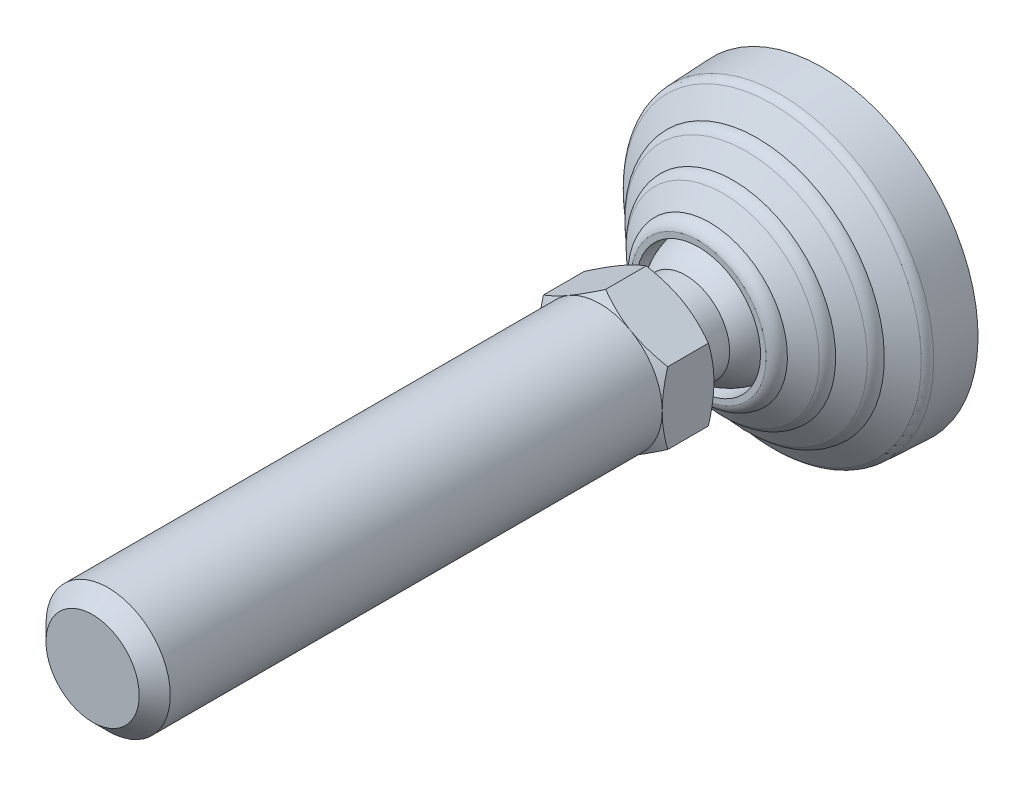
ISO-10303-21;
HEADER;
FILE_DESCRIPTION(('STEP AP214'),'2;1');
FILE_NAME('part.step','',(''),(''),'','','');
FILE_SCHEMA(('AUTOMOTIVE_DESIGN { 1 0 10303 214 1 1 1 1 }'));
ENDSEC;
DATA;
#1=APPLICATION_CONTEXT('core data for automotive mechanical design processes');
#2=APPLICATION_PROTOCOL_DEFINITION('international standard','automotive_design',2000,#1);
#3=PRODUCT_CONTEXT('',#1,'mechanical');
#4=PRODUCT('Part','Part','',(#3));
#5=PRODUCT_RELATED_PRODUCT_CATEGORY('part','',(#4));
#6=PRODUCT_DEFINITION_FORMATION('','',#4);
#7=PRODUCT_DEFINITION_CONTEXT('part definition',#1,'design');
#8=PRODUCT_DEFINITION('design','',#6,#7);
#9=PRODUCT_DEFINITION_SHAPE('','',#8);
#10=(LENGTH_UNIT() NAMED_UNIT(*) SI_UNIT(.MILLI.,.METRE.));
#11=(NAMED_UNIT(*) PLANE_ANGLE_UNIT() SI_UNIT($,.RADIAN.));
#12=(NAMED_UNIT(*) SI_UNIT($,.STERADIAN.) SOLID_ANGLE_UNIT());
#13=UNCERTAINTY_MEASURE_WITH_UNIT(LENGTH_MEASURE(1.E-05),#10,'distance_accuracy_value','');
#14=(GEOMETRIC_REPRESENTATION_CONTEXT(3) GLOBAL_UNCERTAINTY_ASSIGNED_CONTEXT((#13)) GLOBAL_UNIT_ASSIGNED_CONTEXT((#10,
#11,#12)) REPRESENTATION_CONTEXT('',''));
#15=CARTESIAN_POINT('',(0.,0.,0.));
#16=DIRECTION('',(0.,0.,1.));
#17=DIRECTION('',(1.,0.,0.));
#18=AXIS2_PLACEMENT_3D('',#15,#16,#17);
#19=CARTESIAN_POINT('',(0.,0.,30.));
#20=DIRECTION('',(0.,0.,-1.));
#21=DIRECTION('',(0.,1.,0.));
#22=AXIS2_PLACEMENT_3D('',#19,#20,#21);
#23=CYLINDRICAL_SURFACE('',#22,12.);
#24=CARTESIAN_POINT('',(-12.,0.,18.));
#25=CARTESIAN_POINT('',(-12.0000041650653,-0.196349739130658,18.));
#26=CARTESIAN_POINT('',(-11.9951810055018,-0.392699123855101,18.));
#27=CARTESIAN_POINT('',(-11.9759099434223,-0.784925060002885,18.));
#28=CARTESIAN_POINT('',(-11.9614620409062,-0.980801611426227,18.));
#29=CARTESIAN_POINT('',(-11.9229713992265,-1.37160975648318,18.));
#30=CARTESIAN_POINT('',(-11.8989286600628,-1.5665413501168,18.));
#31=CARTESIAN_POINT('',(-11.841307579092,-1.95499003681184,18.));
#32=CARTESIAN_POINT('',(-11.8077292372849,-2.14850712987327,18.));
#33=CARTESIAN_POINT('',(-11.7311174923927,-2.53366059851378,18.));
#34=CARTESIAN_POINT('',(-11.6880840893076,-2.72529697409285,18.));
#35=CARTESIAN_POINT('',(-11.5926659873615,-3.10622734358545,18.));
#36=CARTESIAN_POINT('',(-11.5402812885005,-3.29552133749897,18.));
#37=CARTESIAN_POINT('',(-11.4262867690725,-3.67131091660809,18.));
#38=CARTESIAN_POINT('',(-11.3646769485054,-3.85780650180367,18.));
#39=CARTESIAN_POINT('',(-11.2323806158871,-4.22754997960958,18.));
#40=CARTESIAN_POINT('',(-11.1616941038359,-4.41079787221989,18.));
#41=CARTESIAN_POINT('',(-11.011414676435,-4.77360450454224,18.));
#42=CARTESIAN_POINT('',(-10.9318217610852,-4.95316324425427,18.));
#43=CARTESIAN_POINT('',(-10.7639212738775,-5.30815899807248,18.));
#44=CARTESIAN_POINT('',(-10.6756137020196,-5.48359601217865,18.));
#45=CARTESIAN_POINT('',(-10.4904966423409,-5.82992567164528,17.9999999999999));
#46=CARTESIAN_POINT('',(-10.3936871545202,-6.00081831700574,17.9999999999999));
#47=CARTESIAN_POINT('',(-10.1917994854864,-6.33764754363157,17.9999999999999));
#48=CARTESIAN_POINT('',(-10.0867213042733,-6.50358412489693,17.9999999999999));
#49=CARTESIAN_POINT('',(-9.8685493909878,-6.83010146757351,17.9999999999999));
#50=CARTESIAN_POINT('',(-9.75545565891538,-6.99068222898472,17.9999999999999));
#51=CARTESIAN_POINT('',(-9.5215250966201,-7.30610107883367,17.9999999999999));
#52=CARTESIAN_POINT('',(-9.40068826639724,-7.4609391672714,17.9999999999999));
#53=CARTESIAN_POINT('',(-9.15156261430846,-7.76449965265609,17.9999999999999));
#54=CARTESIAN_POINT('',(-9.02327379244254,-7.91322204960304,17.9999999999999));
#55=CARTESIAN_POINT('',(-8.75955321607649,-8.20419286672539,17.9999999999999));
#56=CARTESIAN_POINT('',(-8.62412146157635,-8.3464412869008,17.9999999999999));
#57=CARTESIAN_POINT('',(-8.3464412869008,-8.62412146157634,17.9999999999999));
#58=CARTESIAN_POINT('',(-8.2041928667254,-8.75955321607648,17.9999999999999));
#59=CARTESIAN_POINT('',(-7.91322204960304,-9.02327379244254,17.9999999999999));
#60=CARTESIAN_POINT('',(-7.76449965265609,-9.15156261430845,17.9999999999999));
#61=CARTESIAN_POINT('',(-7.4609391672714,-9.40068826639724,17.9999999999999));
#62=CARTESIAN_POINT('',(-7.30610107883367,-9.5215250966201,17.9999999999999));
#63=CARTESIAN_POINT('',(-6.99068222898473,-9.75545565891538,17.9999999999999));
#64=CARTESIAN_POINT('',(-6.83010146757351,-9.8685493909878,17.9999999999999));
#65=CARTESIAN_POINT('',(-6.50358412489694,-10.0867213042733,17.9999999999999));
#66=CARTESIAN_POINT('',(-6.33764754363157,-10.1917994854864,17.9999999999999));
#67=CARTESIAN_POINT('',(-6.00081831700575,-10.3936871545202,17.9999999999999));
#68=CARTESIAN_POINT('',(-5.82992567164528,-10.4904966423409,17.9999999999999));
#69=CARTESIAN_POINT('',(-5.48359601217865,-10.6756137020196,17.9999999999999));
#70=CARTESIAN_POINT('',(-5.30815899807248,-10.7639212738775,17.9999999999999));
#71=CARTESIAN_POINT('',(-4.95316324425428,-10.9318217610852,17.9999999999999));
#72=CARTESIAN_POINT('',(-4.77360450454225,-11.011414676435,17.9999999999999));
#73=CARTESIAN_POINT('',(-4.4107978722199,-11.1616941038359,17.9999999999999));
#74=CARTESIAN_POINT('',(-4.22754997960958,-11.2323806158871,17.9999999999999));
#75=CARTESIAN_POINT('',(-3.85780650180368,-11.3646769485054,17.9999999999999));
#76=CARTESIAN_POINT('',(-3.67131091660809,-11.4262867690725,17.9999999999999));
#77=CARTESIAN_POINT('',(-3.29552133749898,-11.5402812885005,17.9999999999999));
#78=CARTESIAN_POINT('',(-3.10622734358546,-11.5926659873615,17.9999999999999));
#79=CARTESIAN_POINT('',(-2.72529697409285,-11.6880840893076,17.9999999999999));
#80=CARTESIAN_POINT('',(-2.53366059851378,-11.7311174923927,17.9999999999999));
#81=CARTESIAN_POINT('',(-2.14850712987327,-11.8077292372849,17.9999999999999));
#82=CARTESIAN_POINT('',(-1.95499003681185,-11.841307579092,17.9999999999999));
#83=CARTESIAN_POINT('',(-1.5665413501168,-11.8989286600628,17.9999999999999));
#84=CARTESIAN_POINT('',(-1.37160975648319,-11.9229713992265,17.9999999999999));
#85=CARTESIAN_POINT('',(-0.980801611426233,-11.9614620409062,17.9999999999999));
#86=CARTESIAN_POINT('',(-0.78492506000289,-11.9759099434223,17.9999999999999));
#87=CARTESIAN_POINT('',(-0.392699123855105,-11.9951810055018,17.9999999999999));
#88=CARTESIAN_POINT('',(-0.196349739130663,-12.0000041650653,17.9999999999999));
#89=CARTESIAN_POINT('',(0.,-12.,17.9999999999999));
#90=B_SPLINE_CURVE_WITH_KNOTS('',3,(#24,#25,#26,#27,#28,#29,#30,#31,#32,#33,#34,#35,#36,#37,#38,
#39,#40,#41,#42,#43,#44,#45,#46,#47,#48,#49,#50,#51,#52,#53,#54,#55,#56,#57,#58,#59,#60,#61,#62,
#63,#64,#65,#66,#67,#68,#69,#70,#71,#72,#73,#74,#75,#76,#77,#78,#79,#80,#81,#82,#83,#84,#85,#86,
#87,#88,#89),.UNSPECIFIED.,.F.,.F.,(4,2,2,2,2,2,2,2,2,2,2,2,2,2,2,2,2,2,2,2,2,2,2,2,2,2,2,2,2,2,
2,2,4),(0.,0.588989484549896,1.17797896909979,1.76696845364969,2.35595793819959,
2.94494742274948,3.53393690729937,4.12292639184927,4.71191587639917,5.30090536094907,
5.88989484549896,6.47888433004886,7.06787381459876,7.65686329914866,8.24585278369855,
8.83484226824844,9.42383175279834,10.0128212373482,10.6018107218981,11.190800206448,
11.7797896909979,12.3687791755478,12.9577686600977,13.5467581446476,14.1357476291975,
14.7247371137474,15.3137265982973,15.9027160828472,16.4917055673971,17.080695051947,
17.6696845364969,18.2586740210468,18.8476635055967),.UNSPECIFIED.);
#91=CARTESIAN_POINT('',(-12.,0.,18.00017943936));
#92=VERTEX_POINT('',#91);
#93=CARTESIAN_POINT('',(0.,-12.,18.));
#94=VERTEX_POINT('',#93);
#95=EDGE_CURVE('E138',#92,#94,#90,.T.);
#96=ORIENTED_EDGE('',*,*,#95,.F.);
#97=CARTESIAN_POINT('',(0.,0.,18.));
#98=DIRECTION('',(0.,0.,-1.));
#99=DIRECTION('',(0.,1.,0.));
#100=AXIS2_PLACEMENT_3D('',#97,#98,#99);
#101=CIRCLE('',#100,12.);
#102=CARTESIAN_POINT('',(0.,12.,18.));
#103=VERTEX_POINT('',#102);
#104=EDGE_CURVE('E134',#103,#92,#101,.F.);
#105=ORIENTED_EDGE('',*,*,#104,.F.);
#106=CARTESIAN_POINT('',(12.,0.,18.));
#107=CARTESIAN_POINT('',(12.0000041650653,0.196349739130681,18.));
#108=CARTESIAN_POINT('',(11.9951810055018,0.392699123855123,18.));
#109=CARTESIAN_POINT('',(11.9759099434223,0.784925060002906,18.));
#110=CARTESIAN_POINT('',(11.9614620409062,0.980801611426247,18.));
#111=CARTESIAN_POINT('',(11.9229713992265,1.3716097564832,18.));
#112=CARTESIAN_POINT('',(11.8989286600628,1.56654135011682,18.));
#113=CARTESIAN_POINT('',(11.841307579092,1.95499003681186,18.));
#114=CARTESIAN_POINT('',(11.8077292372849,2.14850712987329,18.));
#115=CARTESIAN_POINT('',(11.7311174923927,2.53366059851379,18.));
#116=CARTESIAN_POINT('',(11.6880840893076,2.72529697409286,18.));
#117=CARTESIAN_POINT('',(11.5926659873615,3.10622734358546,18.));
#118=CARTESIAN_POINT('',(11.5402812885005,3.29552133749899,18.));
#119=CARTESIAN_POINT('',(11.4262867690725,3.6713109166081,18.));
#120=CARTESIAN_POINT('',(11.3646769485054,3.85780650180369,18.));
#121=CARTESIAN_POINT('',(11.2323806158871,4.22754997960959,18.));
#122=CARTESIAN_POINT('',(11.1616941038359,4.4107978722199,18.));
#123=CARTESIAN_POINT('',(11.011414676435,4.77360450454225,18.));
#124=CARTESIAN_POINT('',(10.9318217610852,4.95316324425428,18.));
#125=CARTESIAN_POINT('',(10.7639212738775,5.30815899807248,18.));
#126=CARTESIAN_POINT('',(10.6756137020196,5.48359601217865,18.));
#127=CARTESIAN_POINT('',(10.4904966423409,5.82992567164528,18.));
#128=CARTESIAN_POINT('',(10.3936871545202,6.00081831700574,18.));
#129=CARTESIAN_POINT('',(10.1917994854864,6.33764754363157,18.));
#130=CARTESIAN_POINT('',(10.0867213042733,6.50358412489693,18.));
#131=CARTESIAN_POINT('',(9.8685493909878,6.83010146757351,18.));
#132=CARTESIAN_POINT('',(9.75545565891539,6.99068222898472,18.));
#133=CARTESIAN_POINT('',(9.5215250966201,7.30610107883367,18.));
#134=CARTESIAN_POINT('',(9.40068826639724,7.4609391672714,18.));
#135=CARTESIAN_POINT('',(9.15156261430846,7.76449965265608,18.));
#136=CARTESIAN_POINT('',(9.02327379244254,7.91322204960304,18.));
#137=CARTESIAN_POINT('',(8.75955321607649,8.20419286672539,18.));
#138=CARTESIAN_POINT('',(8.62412146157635,8.3464412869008,18.));
#139=CARTESIAN_POINT('',(8.34644128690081,8.62412146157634,18.));
#140=CARTESIAN_POINT('',(8.20419286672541,8.75955321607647,18.));
#141=CARTESIAN_POINT('',(7.91322204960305,9.02327379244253,18.));
#142=CARTESIAN_POINT('',(7.7644996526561,9.15156261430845,18.));
#143=CARTESIAN_POINT('',(7.46093916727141,9.40068826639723,18.));
#144=CARTESIAN_POINT('',(7.30610107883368,9.52152509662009,18.));
#145=CARTESIAN_POINT('',(6.99068222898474,9.75545565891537,18.));
#146=CARTESIAN_POINT('',(6.83010146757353,9.86854939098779,18.));
#147=CARTESIAN_POINT('',(6.50358412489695,10.0867213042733,18.));
#148=CARTESIAN_POINT('',(6.33764754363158,10.1917994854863,18.));
#149=CARTESIAN_POINT('',(6.00081831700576,10.3936871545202,18.));
#150=CARTESIAN_POINT('',(5.8299256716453,10.4904966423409,18.));
#151=CARTESIAN_POINT('',(5.48359601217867,10.6756137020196,18.));
#152=CARTESIAN_POINT('',(5.3081589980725,10.7639212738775,18.));
#153=CARTESIAN_POINT('',(4.9531632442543,10.9318217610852,18.));
#154=CARTESIAN_POINT('',(4.77360450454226,11.0114146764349,18.));
#155=CARTESIAN_POINT('',(4.41079787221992,11.1616941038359,18.));
#156=CARTESIAN_POINT('',(4.2275499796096,11.2323806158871,18.));
#157=CARTESIAN_POINT('',(3.85780650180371,11.3646769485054,18.));
#158=CARTESIAN_POINT('',(3.67131091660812,11.4262867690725,18.));
#159=CARTESIAN_POINT('',(3.29552133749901,11.5402812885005,18.));
#160=CARTESIAN_POINT('',(3.10622734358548,11.5926659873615,18.));
#161=CARTESIAN_POINT('',(2.72529697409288,11.6880840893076,18.));
#162=CARTESIAN_POINT('',(2.53366059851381,11.7311174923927,18.));
#163=CARTESIAN_POINT('',(2.1485071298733,11.8077292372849,18.));
#164=CARTESIAN_POINT('',(1.95499003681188,11.841307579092,18.));
#165=CARTESIAN_POINT('',(1.56654135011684,11.8989286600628,18.));
#166=CARTESIAN_POINT('',(1.37160975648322,11.9229713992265,18.));
#167=CARTESIAN_POINT('',(0.980801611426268,11.9614620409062,18.));
#168=CARTESIAN_POINT('',(0.784925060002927,11.9759099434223,18.));
#169=CARTESIAN_POINT('',(0.392699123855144,11.9951810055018,18.));
#170=CARTESIAN_POINT('',(0.196349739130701,12.0000041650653,18.));
#171=CARTESIAN_POINT('',(0.,12.,18.));
#172=B_SPLINE_CURVE_WITH_KNOTS('',3,(#106,#107,#108,#109,#110,#111,#112,#113,#114,#115,#116,
#117,#118,#119,#120,#121,#122,#123,#124,#125,#126,#127,#128,#129,#130,#131,#132,#133,#134,#135,
#136,#137,#138,#139,#140,#141,#142,#143,#144,#145,#146,#147,#148,#149,#150,#151,#152,#153,#154,
#155,#156,#157,#158,#159,#160,#161,#162,#163,#164,#165,#166,#167,#168,#169,#170,#171),
.UNSPECIFIED.,.F.,.F.,(4,2,2,2,2,2,2,2,2,2,2,2,2,2,2,2,2,2,2,2,2,2,2,2,2,2,2,2,2,2,2,2,4),(0.,
0.588989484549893,1.17797896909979,1.76696845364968,2.35595793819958,2.94494742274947,
3.53393690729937,4.12292639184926,4.71191587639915,5.30090536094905,5.88989484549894,
6.47888433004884,7.06787381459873,7.65686329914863,8.24585278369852,8.83484226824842,
9.42383175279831,10.0128212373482,10.6018107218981,11.190800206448,11.7797896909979,
12.3687791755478,12.9577686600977,13.5467581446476,14.1357476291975,14.7247371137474,
15.3137265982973,15.9027160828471,16.491705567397,17.0806950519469,17.6696845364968,
18.2586740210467,18.8476635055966),.UNSPECIFIED.);
#173=CARTESIAN_POINT('',(12.,0.,18.));
#174=VERTEX_POINT('',#173);
#175=EDGE_CURVE('E31',#174,#103,#172,.T.);
#176=ORIENTED_EDGE('',*,*,#175,.F.);
#177=CARTESIAN_POINT('',(0.,0.,18.));
#178=DIRECTION('',(0.,0.,-1.));
#179=DIRECTION('',(0.,1.,0.));
#180=AXIS2_PLACEMENT_3D('',#177,#178,#179);
#181=CIRCLE('',#180,12.);
#182=EDGE_CURVE('E135',#94,#174,#181,.F.);
#183=ORIENTED_EDGE('',*,*,#182,.F.);
#184=EDGE_LOOP('',(#96,#105,#176,#183));
#185=FACE_BOUND('',#184,.T.);
#186=CARTESIAN_POINT('',(0.,0.,24.));
#187=DIRECTION('',(0.,0.,-1.));
#188=DIRECTION('',(0.,1.,0.));
#189=AXIS2_PLACEMENT_3D('',#186,#187,#188);
#190=CIRCLE('',#189,12.);
#191=CARTESIAN_POINT('',(0.,12.,24.));
#192=VERTEX_POINT('',#191);
#193=EDGE_CURVE('E155',#192,#192,#190,.T.);
#194=ORIENTED_EDGE('',*,*,#193,.F.);
#195=EDGE_LOOP('',(#194));
#196=FACE_BOUND('',#195,.T.);
#197=ADVANCED_FACE('F14',(#185,#196),#23,.F.);
#198=CARTESIAN_POINT('',(-6.53226682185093,0.,24.));
#199=DIRECTION('',(0.,0.,1.));
#200=DIRECTION('',(-1.,0.,0.));
#201=AXIS2_PLACEMENT_3D('',#198,#199,#200);
#202=PLANE('',#201);
#203=CARTESIAN_POINT('',(0.,0.,24.));
#204=DIRECTION('',(0.,0.,-1.));
#205=DIRECTION('',(0.,1.,0.));
#206=AXIS2_PLACEMENT_3D('',#203,#204,#205);
#207=CIRCLE('',#206,13.0645336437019);
#208=CARTESIAN_POINT('',(0.,13.0645336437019,24.));
#209=VERTEX_POINT('',#208);
#210=EDGE_CURVE('E151',#209,#209,#207,.T.);
#211=ORIENTED_EDGE('',*,*,#210,.F.);
#212=EDGE_LOOP('',(#211));
#213=FACE_BOUND('',#212,.T.);
#214=ORIENTED_EDGE('',*,*,#193,.T.);
#215=EDGE_LOOP('',(#214));
#216=FACE_BOUND('',#215,.T.);
#217=ADVANCED_FACE('F305',(#213,#216),#202,.T.);
#218=CARTESIAN_POINT('',(0.,0.,21.5842));
#219=DIRECTION('',(0.,0.,-1.));
#220=DIRECTION('',(0.,1.,0.));
#221=AXIS2_PLACEMENT_3D('',#218,#219,#220);
#222=TOROIDAL_SURFACE('',#221,12.5253,2.47525);
#223=ORIENTED_EDGE('',*,*,#210,.T.);
#224=EDGE_LOOP('',(#223));
#225=FACE_BOUND('',#224,.T.);
#226=CARTESIAN_POINT('',(0.,0.,21.8062186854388));
#227=DIRECTION('',(0.,0.,-1.));
#228=DIRECTION('',(-1.,0.,0.));
#229=AXIS2_PLACEMENT_3D('',#226,#227,#228);
#230=CIRCLE('',#229,14.9905728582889);
#231=CARTESIAN_POINT('',(-14.9905728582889,0.,21.8062186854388));
#232=VERTEX_POINT('',#231);
#233=EDGE_CURVE('E154',#232,#232,#230,.T.);
#234=ORIENTED_EDGE('',*,*,#233,.F.);
#235=EDGE_LOOP('',(#234));
#236=FACE_BOUND('',#235,.T.);
#237=ADVANCED_FACE('F473',(#225,#236),#222,.T.);
#238=CARTESIAN_POINT('',(0.,0.,19.3004110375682));
#239=DIRECTION('',(0.,0.,-1.));
#240=DIRECTION('',(0.,1.,0.));
#241=AXIS2_PLACEMENT_3D('',#238,#239,#240);
#242=CONICAL_SURFACE('',#241,18.63040749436,0.967870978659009);
#243=ORIENTED_EDGE('',*,*,#233,.T.);
#244=EDGE_LOOP('',(#243));
#245=FACE_BOUND('',#244,.T.);
#246=CARTESIAN_POINT('',(0.,0.,19.3004110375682));
#247=DIRECTION('',(0.,0.,-1.));
#248=DIRECTION('',(0.,1.,0.));
#249=AXIS2_PLACEMENT_3D('',#246,#247,#248);
#250=CIRCLE('',#249,18.63040749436);
#251=CARTESIAN_POINT('',(0.,18.63040749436,19.3004110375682));
#252=VERTEX_POINT('',#251);
#253=EDGE_CURVE('E530',#252,#252,#250,.T.);
#254=ORIENTED_EDGE('',*,*,#253,.F.);
#255=EDGE_LOOP('',(#254));
#256=FACE_BOUND('',#255,.T.);
#257=ADVANCED_FACE('F463',(#245,#256),#242,.T.);
#258=CARTESIAN_POINT('',(0.,0.,17.149417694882));
#259=DIRECTION('',(0.,0.,-1.));
#260=DIRECTION('',(0.,1.,0.));
#261=AXIS2_PLACEMENT_3D('',#258,#259,#260);
#262=TOROIDAL_SURFACE('',#261,17.1699621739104,2.59993709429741);
#263=CARTESIAN_POINT('',(0.,0.,17.266146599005));
#264=DIRECTION('',(0.,0.,-1.));
#265=DIRECTION('',(-1.,0.,0.));
#266=AXIS2_PLACEMENT_3D('',#263,#264,#265);
#267=CIRCLE('',#266,19.7672775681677);
#268=CARTESIAN_POINT('',(-19.7672775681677,0.,17.266146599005));
#269=VERTEX_POINT('',#268);
#270=EDGE_CURVE('E533',#269,#269,#267,.T.);
#271=ORIENTED_EDGE('',*,*,#270,.F.);
#272=EDGE_LOOP('',(#271));
#273=FACE_BOUND('',#272,.T.);
#274=ORIENTED_EDGE('',*,*,#253,.T.);
#275=EDGE_LOOP('',(#274));
#276=FACE_BOUND('',#275,.T.);
#277=ADVANCED_FACE('F453',(#273,#276),#262,.T.);
#278=CARTESIAN_POINT('',(0.,0.,14.7704000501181));
#279=DIRECTION('',(0.,0.,-1.));
#280=DIRECTION('',(0.,1.,0.));
#281=AXIS2_PLACEMENT_3D('',#278,#279,#280);
#282=CONICAL_SURFACE('',#281,23.3925000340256,0.967871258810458);
#283=CARTESIAN_POINT('',(0.,0.,14.7704000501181));
#284=DIRECTION('',(0.,0.,-1.));
#285=DIRECTION('',(0.,1.,0.));
#286=AXIS2_PLACEMENT_3D('',#283,#284,#285);
#287=CIRCLE('',#286,23.3925000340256);
#288=CARTESIAN_POINT('',(0.,23.3925000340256,14.7704000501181));
#289=VERTEX_POINT('',#288);
#290=EDGE_CURVE('E541',#289,#289,#287,.T.);
#291=ORIENTED_EDGE('',*,*,#290,.F.);
#292=EDGE_LOOP('',(#291));
#293=FACE_BOUND('',#292,.T.);
#294=ORIENTED_EDGE('',*,*,#270,.T.);
#295=EDGE_LOOP('',(#294));
#296=FACE_BOUND('',#295,.T.);
#297=ADVANCED_FACE('F443',(#293,#296),#282,.T.);
#298=CARTESIAN_POINT('',(0.,0.,12.6193000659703));
#299=DIRECTION('',(0.,0.,-1.));
#300=DIRECTION('',(0.,1.,0.));
#301=AXIS2_PLACEMENT_3D('',#298,#299,#300);
#302=TOROIDAL_SURFACE('',#301,21.9321002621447,2.59999973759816);
#303=ORIENTED_EDGE('',*,*,#290,.T.);
#304=EDGE_LOOP('',(#303));
#305=FACE_BOUND('',#304,.T.);
#306=CARTESIAN_POINT('',(0.,0.,12.6295138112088));
#307=DIRECTION('',(0.,0.,-1.));
#308=DIRECTION('',(-1.,0.,0.));
#309=AXIS2_PLACEMENT_3D('',#306,#307,#308);
#310=CIRCLE('',#309,24.5320799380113);
#311=CARTESIAN_POINT('',(-24.5320799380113,0.,12.6295138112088));
#312=VERTEX_POINT('',#311);
#313=EDGE_CURVE('E547',#312,#312,#310,.T.);
#314=ORIENTED_EDGE('',*,*,#313,.F.);
#315=EDGE_LOOP('',(#314));
#316=FACE_BOUND('',#315,.T.);
#317=ADVANCED_FACE('F433',(#305,#316),#302,.T.);
#318=CARTESIAN_POINT('',(0.,0.,9.71835625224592));
#319=DIRECTION('',(0.,0.,-1.));
#320=DIRECTION('',(0.,1.,0.));
#321=AXIS2_PLACEMENT_3D('',#318,#319,#320);
#322=CONICAL_SURFACE('',#321,28.760790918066,0.967879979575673);
#323=ORIENTED_EDGE('',*,*,#313,.T.);
#324=EDGE_LOOP('',(#323));
#325=FACE_BOUND('',#324,.T.);
#326=CARTESIAN_POINT('',(0.,0.,9.71835625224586));
#327=DIRECTION('',(0.,0.,-1.));
#328=DIRECTION('',(0.,1.,0.));
#329=AXIS2_PLACEMENT_3D('',#326,#327,#328);
#330=CIRCLE('',#329,28.760790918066);
#331=CARTESIAN_POINT('',(0.,28.760790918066,9.71835625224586));
#332=VERTEX_POINT('',#331);
#333=EDGE_CURVE('E550',#332,#332,#330,.T.);
#334=ORIENTED_EDGE('',*,*,#333,.F.);
#335=EDGE_LOOP('',(#334));
#336=FACE_BOUND('',#335,.T.);
#337=ADVANCED_FACE('F423',(#325,#336),#322,.T.);
#338=CARTESIAN_POINT('',(0.,0.,8.07109690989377));
#339=DIRECTION('',(0.,0.,-1.));
#340=DIRECTION('',(0.,1.,0.));
#341=AXIS2_PLACEMENT_3D('',#338,#339,#340);
#342=TOROIDAL_SURFACE('',#341,27.6268354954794,1.9998295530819);
#343=CARTESIAN_POINT('',(0.,0.,8.17566154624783));
#344=DIRECTION('',(0.,0.,-1.));
#345=DIRECTION('',(-1.,0.,0.));
#346=AXIS2_PLACEMENT_3D('',#343,#344,#345);
#347=CIRCLE('',#346,29.6239295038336);
#348=CARTESIAN_POINT('',(-29.6239295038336,0.,8.17566154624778));
#349=VERTEX_POINT('',#348);
#350=EDGE_CURVE('E150',#349,#349,#347,.T.);
#351=ORIENTED_EDGE('',*,*,#350,.F.);
#352=EDGE_LOOP('',(#351));
#353=FACE_BOUND('',#352,.T.);
#354=ORIENTED_EDGE('',*,*,#333,.T.);
#355=EDGE_LOOP('',(#354));
#356=FACE_BOUND('',#355,.T.);
#357=ADVANCED_FACE('F412',(#353,#356),#342,.T.);
#358=CARTESIAN_POINT('',(0.,0.,0.));
#359=DIRECTION('',(0.,0.,-1.));
#360=DIRECTION('',(0.,1.,0.));
#361=AXIS2_PLACEMENT_3D('',#358,#359,#360);
#362=CONICAL_SURFACE('',#361,30.,0.0459663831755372);
#363=CARTESIAN_POINT('',(0.,0.,0.));
#364=DIRECTION('',(0.,0.,-1.));
#365=DIRECTION('',(0.,1.,0.));
#366=AXIS2_PLACEMENT_3D('',#363,#364,#365);
#367=CIRCLE('',#366,30.);
#368=CARTESIAN_POINT('',(0.,30.,0.));
#369=VERTEX_POINT('',#368);
#370=EDGE_CURVE('E147',#369,#369,#367,.T.);
#371=ORIENTED_EDGE('',*,*,#370,.F.);
#372=EDGE_LOOP('',(#371));
#373=FACE_BOUND('',#372,.T.);
#374=ORIENTED_EDGE('',*,*,#350,.T.);
#375=EDGE_LOOP('',(#374));
#376=FACE_BOUND('',#375,.T.);
#377=ADVANCED_FACE('F297',(#373,#376),#362,.T.);
#378=CARTESIAN_POINT('',(-15.,0.,0.));
#379=DIRECTION('',(0.,0.,-1.));
#380=DIRECTION('',(0.,1.,0.));
#381=AXIS2_PLACEMENT_3D('',#378,#379,#380);
#382=PLANE('',#381);
#383=ORIENTED_EDGE('',*,*,#370,.T.);
#384=EDGE_LOOP('',(#383));
#385=FACE_BOUND('',#384,.T.);
#386=ADVANCED_FACE('F117',(#385),#382,.T.);
#387=CARTESIAN_POINT('',(0.,0.,90.1595));
#388=DIRECTION('',(0.,0.,-1.));
#389=DIRECTION('',(0.,1.,0.));
#390=AXIS2_PLACEMENT_3D('',#387,#388,#389);
#391=CYLINDRICAL_SURFACE('',#390,12.);
#392=CARTESIAN_POINT('',(0.,0.,138.));
#393=DIRECTION('',(0.,0.,1.));
#394=DIRECTION('',(0.,-1.,0.));
#395=AXIS2_PLACEMENT_3D('',#392,#393,#394);
#396=CIRCLE('',#395,12.);
#397=CARTESIAN_POINT('',(0.,-12.,138.));
#398=VERTEX_POINT('',#397);
#399=EDGE_CURVE('E9',#398,#398,#396,.F.);
#400=ORIENTED_EDGE('',*,*,#399,.T.);
#401=EDGE_LOOP('',(#400));
#402=FACE_BOUND('',#401,.T.);
#403=CARTESIAN_POINT('',(0.,0.,43.));
#404=DIRECTION('',(0.,0.,-1.));
#405=DIRECTION('',(0.,1.,0.));
#406=AXIS2_PLACEMENT_3D('',#403,#404,#405);
#407=CIRCLE('',#406,12.);
#408=CARTESIAN_POINT('',(0.,12.,43.));
#409=VERTEX_POINT('',#408);
#410=EDGE_CURVE('E136',#409,#409,#407,.F.);
#411=ORIENTED_EDGE('',*,*,#410,.T.);
#412=EDGE_LOOP('',(#411));
#413=FACE_BOUND('',#412,.T.);
#414=ADVANCED_FACE('F287',(#402,#413),#391,.T.);
#415=CARTESIAN_POINT('',(11.995,0.,43.));
#416=DIRECTION('',(0.,0.,-1.));
#417=DIRECTION('',(0.,1.,0.));
#418=AXIS2_PLACEMENT_3D('',#415,#416,#417);
#419=PLANE('',#418);
#420=CARTESIAN_POINT('',(0.,0.,43.));
#421=DIRECTION('',(0.,0.,-1.));
#422=DIRECTION('',(0.,1.,0.));
#423=AXIS2_PLACEMENT_3D('',#420,#421,#422);
#424=CIRCLE('',#423,11.99);
#425=CARTESIAN_POINT('',(0.,11.99,43.));
#426=VERTEX_POINT('',#425);
#427=EDGE_CURVE('E577',#426,#426,#424,.F.);
#428=ORIENTED_EDGE('',*,*,#427,.T.);
#429=EDGE_LOOP('',(#428));
#430=FACE_BOUND('',#429,.T.);
#431=ORIENTED_EDGE('',*,*,#410,.F.);
#432=EDGE_LOOP('',(#431));
#433=FACE_BOUND('',#432,.T.);
#434=ADVANCED_FACE('F254',(#430,#433),#419,.T.);
#435=CARTESIAN_POINT('',(0.,0.,41.9159643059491));
#436=DIRECTION('',(0.,0.,-1.));
#437=DIRECTION('',(0.,1.,0.));
#438=AXIS2_PLACEMENT_3D('',#435,#436,#437);
#439=CONICAL_SURFACE('',#438,13.8676048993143,1.0471975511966);
#440=ORIENTED_EDGE('',*,*,#427,.F.);
#441=EDGE_LOOP('',(#440));
#442=FACE_BOUND('',#441,.T.);
#443=CARTESIAN_POINT('',(-2.30779106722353E-08,13.856406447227,41.9224297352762));
#444=CARTESIAN_POINT('',(-0.263784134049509,13.7041106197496,42.0103407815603));
#445=CARTESIAN_POINT('',(-0.528551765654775,13.5512469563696,42.0942615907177));
#446=CARTESIAN_POINT('',(-1.06021024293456,13.2442937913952,42.2530155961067));
#447=CARTESIAN_POINT('',(-1.32710175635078,13.0902039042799,42.3278458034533));
#448=CARTESIAN_POINT('',(-2.13207652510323,12.6254515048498,42.5372522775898));
#449=CARTESIAN_POINT('',(-2.6733374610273,12.3129543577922,42.656360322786));
#450=CARTESIAN_POINT('',(-3.48330959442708,11.8453167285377,42.7960231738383));
#451=CARTESIAN_POINT('',(-3.74960112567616,11.6915732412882,42.8358073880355));
#452=CARTESIAN_POINT('',(-4.28341703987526,11.3833744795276,42.9025217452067));
#453=CARTESIAN_POINT('',(-4.550941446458,11.2289191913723,42.9294516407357));
#454=CARTESIAN_POINT('',(-5.08643618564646,10.9197511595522,42.9697675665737));
#455=CARTESIAN_POINT('',(-5.35440560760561,10.7650389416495,42.9831696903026));
#456=CARTESIAN_POINT('',(-5.89059263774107,10.4554712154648,42.9961444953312));
#457=CARTESIAN_POINT('',(-6.15881023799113,10.300615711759,42.9957176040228));
#458=CARTESIAN_POINT('',(-6.66023033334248,10.0111206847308,42.9820002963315));
#459=CARTESIAN_POINT('',(-6.89346861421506,9.87646050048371,42.9703830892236));
#460=CARTESIAN_POINT('',(-7.359408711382,9.60744985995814,42.9369099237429));
#461=CARTESIAN_POINT('',(-7.59211048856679,9.4730994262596,42.9150532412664));
#462=CARTESIAN_POINT('',(-8.05685112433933,9.20478129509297,42.8614821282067));
#463=CARTESIAN_POINT('',(-8.28888927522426,9.07081400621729,42.8297595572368));
#464=CARTESIAN_POINT('',(-8.75187778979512,8.8035074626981,42.7570131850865));
#465=CARTESIAN_POINT('',(-8.98282807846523,8.67016825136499,42.7159887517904));
#466=CARTESIAN_POINT('',(-9.68388988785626,8.26541002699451,42.5779256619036));
#467=CARTESIAN_POINT('',(-10.1519713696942,7.9951630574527,42.4671213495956));
#468=CARTESIAN_POINT('',(-11.0811551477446,7.45869855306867,42.2156417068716));
#469=CARTESIAN_POINT('',(-11.5422693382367,7.19247415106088,42.0750254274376));
#470=CARTESIAN_POINT('',(-11.9999999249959,6.92820327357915,41.922429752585));
#471=B_SPLINE_CURVE_WITH_KNOTS('',3,(#443,#444,#445,#446,#447,#448,#449,#450,#451,#452,#453,
#454,#455,#456,#457,#458,#459,#460,#461,#462,#463,#464,#465,#466,#467,#468,#469,#470),
.UNSPECIFIED.,.F.,.F.,(4,2,2,2,2,2,2,2,2,2,2,2,2,4),(0.,0.950996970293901,1.90230577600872,
3.80897260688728,4.73890630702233,5.6688579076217,6.59770187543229,7.52651713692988,
8.33503480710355,9.14360966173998,9.95285345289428,10.7621522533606,12.4163367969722,
14.0672748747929),.UNSPECIFIED.);
#472=CARTESIAN_POINT('',(-1.15389586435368E-08,13.856406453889,41.92242973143));
#473=VERTEX_POINT('',#472);
#474=CARTESIAN_POINT('',(-12.,6.92820324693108,41.9224297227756));
#475=VERTEX_POINT('',#474);
#476=EDGE_CURVE('E100',#473,#475,#471,.T.);
#477=ORIENTED_EDGE('',*,*,#476,.T.);
#478=CARTESIAN_POINT('',(-12.,6.92820326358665,41.9224297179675));
#479=CARTESIAN_POINT('',(-12.,6.64374493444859,42.0045333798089));
#480=CARTESIAN_POINT('',(-12.,6.35829458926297,42.0831531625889));
#481=CARTESIAN_POINT('',(-12.,5.78524260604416,42.2325348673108));
#482=CARTESIAN_POINT('',(-12.,5.49764024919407,42.3032940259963));
#483=CARTESIAN_POINT('',(-12.,4.63053083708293,42.5026195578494));
#484=CARTESIAN_POINT('',(-12.,4.04782834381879,42.6179071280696));
#485=CARTESIAN_POINT('',(-12.,3.17548925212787,42.7575170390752));
#486=CARTESIAN_POINT('',(-12.,2.88840964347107,42.7982045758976));
#487=CARTESIAN_POINT('',(-12.,2.31290718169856,42.8685767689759));
#488=CARTESIAN_POINT('',(-12.,2.02448443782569,42.8982623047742));
#489=CARTESIAN_POINT('',(-12.,1.44696804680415,42.9459902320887));
#490=CARTESIAN_POINT('',(-12.,1.15787537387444,42.9640443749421));
#491=CARTESIAN_POINT('',(-12.,0.579188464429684,42.9881624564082));
#492=CARTESIAN_POINT('',(-12.,0.289594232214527,42.994226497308));
#493=CARTESIAN_POINT('',(-12.,-0.289594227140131,42.9942264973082));
#494=CARTESIAN_POINT('',(-12.,-0.579188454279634,42.9881624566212));
#495=CARTESIAN_POINT('',(-12.,-1.15787535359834,42.9640443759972));
#496=CARTESIAN_POINT('',(-12.,-1.44696802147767,42.9459902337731));
#497=CARTESIAN_POINT('',(-12.,-2.02448440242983,42.8982623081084));
#498=CARTESIAN_POINT('',(-12.,-2.31290714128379,42.8685767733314));
#499=CARTESIAN_POINT('',(-12.,-2.88840959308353,42.798204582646));
#500=CARTESIAN_POINT('',(-12.,-3.17548919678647,42.7575170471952));
#501=CARTESIAN_POINT('',(-12.,-4.04782827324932,42.6179071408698));
#502=CARTESIAN_POINT('',(-12.,-4.63053075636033,42.5026195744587));
#503=CARTESIAN_POINT('',(-12.,-5.49764015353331,42.3032940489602));
#504=CARTESIAN_POINT('',(-12.,-5.78524250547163,42.2325348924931));
#505=CARTESIAN_POINT('',(-12.,-6.35829447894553,42.0831531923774));
#506=CARTESIAN_POINT('',(-12.,-6.64374481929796,42.004533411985));
#507=CARTESIAN_POINT('',(-12.,-6.92820314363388,41.9224297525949));
#508=B_SPLINE_CURVE_WITH_KNOTS('',3,(#478,#479,#480,#481,#482,#483,#484,#485,#486,#487,#488,
#489,#490,#491,#492,#493,#494,#495,#496,#497,#498,#499,#500,#501,#502,#503,#504,#505,#506,#507),
.UNSPECIFIED.,.F.,.F.,(4,2,2,2,2,2,2,2,2,2,2,2,2,2,4),(0.,0.888148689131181,1.77660860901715,
3.55698615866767,4.42666281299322,5.2962699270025,6.16499708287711,7.03371682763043,
7.90243655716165,8.7711636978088,9.64077079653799,10.5104474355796,12.2908249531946,
13.1792848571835,14.0674335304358),.UNSPECIFIED.);
#509=CARTESIAN_POINT('',(-12.0000000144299,-6.92820322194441,41.9224297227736));
#510=VERTEX_POINT('',#509);
#511=EDGE_CURVE('E268',#475,#510,#508,.T.);
#512=ORIENTED_EDGE('',*,*,#511,.T.);
#513=CARTESIAN_POINT('',(-12.0000000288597,-6.92820321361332,41.9224297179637));
#514=CARTESIAN_POINT('',(-11.7362159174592,-7.08049904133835,42.0103407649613));
#515=CARTESIAN_POINT('',(-11.471448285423,-7.23336270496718,42.0942615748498));
#516=CARTESIAN_POINT('',(-10.9397898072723,-7.54031587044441,42.2530155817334));
#517=CARTESIAN_POINT('',(-10.6728982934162,-7.69440575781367,42.3278457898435));
#518=CARTESIAN_POINT('',(-9.86792352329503,-8.15915815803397,42.5372522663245));
#519=CARTESIAN_POINT('',(-9.32666258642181,-8.47165530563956,42.6563603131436));
#520=CARTESIAN_POINT('',(-8.51669045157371,-8.93929293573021,42.7960231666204));
#521=CARTESIAN_POINT('',(-8.25039891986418,-9.09303642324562,42.8358073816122));
#522=CARTESIAN_POINT('',(-7.71658300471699,-9.40123518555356,42.9025217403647));
#523=CARTESIAN_POINT('',(-7.44905859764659,-9.55569047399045,42.9294516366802));
#524=CARTESIAN_POINT('',(-6.91356385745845,-9.8648585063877,42.9697675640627));
#525=CARTESIAN_POINT('',(-6.64559443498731,-10.019570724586,42.9831696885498));
#526=CARTESIAN_POINT('',(-6.10940740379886,-10.3291384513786,42.996144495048));
#527=CARTESIAN_POINT('',(-5.84118980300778,-10.4839939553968,42.9957176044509));
#528=CARTESIAN_POINT('',(-5.33976970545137,-10.7734889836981,42.9820002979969));
#529=CARTESIAN_POINT('',(-5.10653142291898,-10.9081491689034,42.9703830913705));
#530=CARTESIAN_POINT('',(-4.64059132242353,-11.1771598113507,42.9369099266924));
#531=CARTESIAN_POINT('',(-4.40788954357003,-11.3115102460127,42.9150532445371));
#532=CARTESIAN_POINT('',(-3.94314890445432,-11.5798283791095,42.8614821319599));
#533=CARTESIAN_POINT('',(-3.71111075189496,-11.7137956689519,42.829759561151));
#534=CARTESIAN_POINT('',(-3.24812223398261,-11.9811022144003,42.7570131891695));
#535=CARTESIAN_POINT('',(-3.01717194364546,-12.1144414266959,42.7159887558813));
#536=CARTESIAN_POINT('',(-2.31611012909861,-12.5191996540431,42.5779256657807));
#537=CARTESIAN_POINT('',(-1.84802864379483,-12.7894466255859,42.4671213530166));
#538=CARTESIAN_POINT('',(-0.918844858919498,-13.3259111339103,42.215641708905));
#539=CARTESIAN_POINT('',(-0.457730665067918,-13.5921355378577,42.0750254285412));
#540=CARTESIAN_POINT('',(-7.50040968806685E-08,-13.8564064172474,41.922429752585));
#541=B_SPLINE_CURVE_WITH_KNOTS('',3,(#513,#514,#515,#516,#517,#518,#519,#520,#521,#522,#523,
#524,#525,#526,#527,#528,#529,#530,#531,#532,#533,#534,#535,#536,#537,#538,#539,#540),
.UNSPECIFIED.,.F.,.F.,(4,2,2,2,2,2,2,2,2,2,2,2,2,4),(0.,0.950996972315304,1.90230578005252,
3.80897261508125,4.73890631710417,5.66885791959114,6.59770188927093,7.52651715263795,
8.33503482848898,9.14360968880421,9.95285348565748,10.7621522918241,12.4163368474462,
14.0672749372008),.UNSPECIFIED.);
#542=CARTESIAN_POINT('',(-1.44241383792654E-08,-13.8564064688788,41.9224297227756));
#543=VERTEX_POINT('',#542);
#544=EDGE_CURVE('E239',#510,#543,#541,.T.);
#545=ORIENTED_EDGE('',*,*,#544,.T.);
#546=CARTESIAN_POINT('',(-2.88482840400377E-08,-13.8564064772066,41.9224297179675));
#547=CARTESIAN_POINT('',(0.263784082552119,-13.7041106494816,42.0103407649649));
#548=CARTESIAN_POINT('',(0.528551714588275,-13.5512469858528,42.0942615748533));
#549=CARTESIAN_POINT('',(1.06021019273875,-13.2442938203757,42.2530155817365));
#550=CARTESIAN_POINT('',(1.32710170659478,-13.0902039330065,42.3278457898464));
#551=CARTESIAN_POINT('',(2.13207647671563,-12.6254515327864,42.537252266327));
#552=CARTESIAN_POINT('',(2.67333741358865,-12.3129543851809,42.6563603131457));
#553=CARTESIAN_POINT('',(3.48330954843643,-11.8453167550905,42.796023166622));
#554=CARTESIAN_POINT('',(3.74960108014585,-11.6915732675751,42.8358073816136));
#555=CARTESIAN_POINT('',(4.28341699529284,-11.3833745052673,42.9025217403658));
#556=CARTESIAN_POINT('',(4.55094140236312,-11.2289192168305,42.9294516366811));
#557=CARTESIAN_POINT('',(5.08643614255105,-10.9197511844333,42.9697675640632));
#558=CARTESIAN_POINT('',(5.35440556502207,-10.7650389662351,42.9831696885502));
#559=CARTESIAN_POINT('',(5.8905925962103,-10.4554712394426,42.996144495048));
#560=CARTESIAN_POINT('',(6.15881019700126,-10.3006157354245,42.9957176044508));
#561=CARTESIAN_POINT('',(6.66023029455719,-10.0111207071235,42.9820002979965));
#562=CARTESIAN_POINT('',(6.8934685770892,-9.87646052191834,42.97038309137));
#563=CARTESIAN_POINT('',(7.35940867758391,-9.60744987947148,42.9369099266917));
#564=CARTESIAN_POINT('',(7.59211045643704,-9.47309944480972,42.9150532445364));
#565=CARTESIAN_POINT('',(8.05685109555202,-9.20478131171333,42.8614821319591));
#566=CARTESIAN_POINT('',(8.28888924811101,-9.07081402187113,42.8297595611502));
#567=CARTESIAN_POINT('',(8.75187776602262,-8.80350747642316,42.7570131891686));
#568=CARTESIAN_POINT('',(8.9828280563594,-8.6701682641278,42.7159887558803));
#569=CARTESIAN_POINT('',(9.68388987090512,-8.26541003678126,42.5779256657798));
#570=CARTESIAN_POINT('',(10.1519713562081,-7.99516306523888,42.4671213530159));
#571=CARTESIAN_POINT('',(11.081155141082,-7.45869855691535,42.2156417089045));
#572=CARTESIAN_POINT('',(11.5422693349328,-7.19247415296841,42.075025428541));
#573=CARTESIAN_POINT('',(11.9999999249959,-6.92820327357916,41.922429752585));
#574=B_SPLINE_CURVE_WITH_KNOTS('',3,(#546,#547,#548,#549,#550,#551,#552,#553,#554,#555,#556,
#557,#558,#559,#560,#561,#562,#563,#564,#565,#566,#567,#568,#569,#570,#571,#572,#573),
.UNSPECIFIED.,.F.,.F.,(4,2,2,2,2,2,2,2,2,2,2,2,2,4),(0.,0.950996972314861,1.90230578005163,
3.80897261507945,4.73890631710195,5.66885791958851,6.59770188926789,7.52651715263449,
8.33503482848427,9.14360968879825,9.95285348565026,10.7621522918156,12.4163368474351,
14.0672749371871),.UNSPECIFIED.);
#575=CARTESIAN_POINT('',(12.,-6.92820324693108,41.9224297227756));
#576=VERTEX_POINT('',#575);
#577=EDGE_CURVE('E230',#543,#576,#574,.T.);
#578=ORIENTED_EDGE('',*,*,#577,.T.);
#579=CARTESIAN_POINT('',(12.,-6.92820326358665,41.9224297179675));
#580=CARTESIAN_POINT('',(12.,-6.64374493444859,42.0045333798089));
#581=CARTESIAN_POINT('',(12.,-6.35829458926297,42.0831531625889));
#582=CARTESIAN_POINT('',(12.,-5.78524260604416,42.2325348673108));
#583=CARTESIAN_POINT('',(12.,-5.49764024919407,42.3032940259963));
#584=CARTESIAN_POINT('',(12.,-4.63053083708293,42.5026195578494));
#585=CARTESIAN_POINT('',(12.,-4.04782834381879,42.6179071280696));
#586=CARTESIAN_POINT('',(12.,-3.17548925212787,42.7575170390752));
#587=CARTESIAN_POINT('',(12.,-2.88840964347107,42.7982045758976));
#588=CARTESIAN_POINT('',(12.,-2.31290718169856,42.8685767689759));
#589=CARTESIAN_POINT('',(12.,-2.02448443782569,42.8982623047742));
#590=CARTESIAN_POINT('',(12.,-1.44696804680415,42.9459902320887));
#591=CARTESIAN_POINT('',(12.,-1.15787537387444,42.9640443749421));
#592=CARTESIAN_POINT('',(12.,-0.579188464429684,42.9881624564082));
#593=CARTESIAN_POINT('',(12.,-0.289594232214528,42.994226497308));
#594=CARTESIAN_POINT('',(12.,0.289594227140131,42.9942264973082));
#595=CARTESIAN_POINT('',(12.,0.579188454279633,42.9881624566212));
#596=CARTESIAN_POINT('',(12.,1.15787535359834,42.9640443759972));
#597=CARTESIAN_POINT('',(12.,1.44696802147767,42.9459902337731));
#598=CARTESIAN_POINT('',(12.,2.02448440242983,42.8982623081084));
#599=CARTESIAN_POINT('',(12.,2.31290714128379,42.8685767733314));
#600=CARTESIAN_POINT('',(12.,2.88840959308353,42.798204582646));
#601=CARTESIAN_POINT('',(12.,3.17548919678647,42.7575170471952));
#602=CARTESIAN_POINT('',(12.,4.04782827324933,42.6179071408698));
#603=CARTESIAN_POINT('',(12.,4.63053075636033,42.5026195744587));
#604=CARTESIAN_POINT('',(12.,5.49764015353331,42.3032940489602));
#605=CARTESIAN_POINT('',(12.,5.78524250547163,42.2325348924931));
#606=CARTESIAN_POINT('',(12.,6.35829447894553,42.0831531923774));
#607=CARTESIAN_POINT('',(12.,6.64374481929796,42.004533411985));
#608=CARTESIAN_POINT('',(12.,6.92820314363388,41.9224297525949));
#609=B_SPLINE_CURVE_WITH_KNOTS('',3,(#579,#580,#581,#582,#583,#584,#585,#586,#587,#588,#589,
#590,#591,#592,#593,#594,#595,#596,#597,#598,#599,#600,#601,#602,#603,#604,#605,#606,#607,#608),
.UNSPECIFIED.,.F.,.F.,(4,2,2,2,2,2,2,2,2,2,2,2,2,2,4),(0.,0.888148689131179,1.77660860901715,
3.55698615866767,4.42666281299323,5.2962699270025,6.16499708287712,7.03371682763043,
7.90243655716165,8.7711636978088,9.64077079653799,10.5104474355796,12.2908249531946,
13.1792848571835,14.0674335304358),.UNSPECIFIED.);
#610=CARTESIAN_POINT('',(12.0000000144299,6.92820322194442,41.9224297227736));
#611=VERTEX_POINT('',#610);
#612=EDGE_CURVE('E238',#576,#611,#609,.T.);
#613=ORIENTED_EDGE('',*,*,#612,.T.);
#614=CARTESIAN_POINT('',(12.0000000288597,6.92820321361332,41.9224297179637));
#615=CARTESIAN_POINT('',(11.7362159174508,7.08049904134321,42.0103407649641));
#616=CARTESIAN_POINT('',(11.4714482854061,7.23336270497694,42.0942615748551));
#617=CARTESIAN_POINT('',(10.9397898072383,7.54031587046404,42.2530155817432));
#618=CARTESIAN_POINT('',(10.6728982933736,7.69440575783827,42.3278457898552));
#619=CARTESIAN_POINT('',(9.86792352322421,8.15915815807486,42.5372522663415));
#620=CARTESIAN_POINT('',(9.32666258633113,8.47165530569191,42.6563603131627));
#621=CARTESIAN_POINT('',(8.51669045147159,8.93929293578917,42.7960231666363));
#622=CARTESIAN_POINT('',(8.25039891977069,9.0930364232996,42.8358073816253));
#623=CARTESIAN_POINT('',(7.71658300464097,9.40123518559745,42.9025217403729));
#624=CARTESIAN_POINT('',(7.44905859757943,9.55569047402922,42.9294516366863));
#625=CARTESIAN_POINT('',(6.91356385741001,9.86485850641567,42.9697675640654));
#626=CARTESIAN_POINT('',(6.64559443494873,10.0195707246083,42.9831696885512));
#627=CARTESIAN_POINT('',(6.10940740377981,10.3291384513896,42.996144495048));
#628=CARTESIAN_POINT('',(5.84118980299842,10.4839939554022,42.9957176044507));
#629=CARTESIAN_POINT('',(5.33976970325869,10.773488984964,42.9820002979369));
#630=CARTESIAN_POINT('',(5.10653141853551,10.9081491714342,42.970383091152));
#631=CARTESIAN_POINT('',(4.64059131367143,11.1771598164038,42.9369099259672));
#632=CARTESIAN_POINT('',(4.4078895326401,11.3115102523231,42.9150532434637));
#633=CARTESIAN_POINT('',(3.94314888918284,11.5798283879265,42.8614821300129));
#634=CARTESIAN_POINT('',(3.71111073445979,11.7137956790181,42.8297595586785));
#635=CARTESIAN_POINT('',(3.24812221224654,11.9811022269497,42.7570131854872));
#636=CARTESIAN_POINT('',(3.01717191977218,12.1144414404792,42.7159887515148));
#637=CARTESIAN_POINT('',(2.31611009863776,12.5191996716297,42.5779256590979));
#638=CARTESIAN_POINT('',(1.84802860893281,12.7894466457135,42.4671213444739));
#639=CARTESIAN_POINT('',(0.918844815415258,13.3259111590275,42.2156416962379));
#640=CARTESIAN_POINT('',(0.457730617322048,13.5921355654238,42.0750254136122));
#641=CARTESIAN_POINT('',(2.30778996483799E-08,13.856406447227,41.9224297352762));
#642=B_SPLINE_CURVE_WITH_KNOTS('',3,(#614,#615,#616,#617,#618,#619,#620,#621,#622,#623,#624,
#625,#626,#627,#628,#629,#630,#631,#632,#633,#634,#635,#636,#637,#638,#639,#640,#641),
.UNSPECIFIED.,.F.,.F.,(4,2,2,2,2,2,2,2,2,2,2,2,2,4),(0.,0.95099697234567,1.9023057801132,
3.8089726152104,4.73890631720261,5.66885791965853,6.59770188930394,7.52651715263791,
8.33503483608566,9.14360970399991,9.95285350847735,10.7621523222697,12.4163368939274,
14.0672749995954),.UNSPECIFIED.);
#643=EDGE_CURVE('E259',#611,#473,#642,.T.);
#644=ORIENTED_EDGE('',*,*,#643,.T.);
#645=EDGE_LOOP('',(#477,#512,#545,#578,#613,#644));
#646=FACE_BOUND('',#645,.T.);
#647=ADVANCED_FACE('F250',(#442,#646),#439,.T.);
#648=CARTESIAN_POINT('',(0.,-13.856406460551,43.1));
#649=DIRECTION('',(0.5,0.866025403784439,0.));
#650=DIRECTION('',(-0.866025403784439,0.5,0.));
#651=AXIS2_PLACEMENT_3D('',#648,#649,#650);
#652=PLANE('',#651);
#653=DIRECTION('',(0.,0.,1.));
#654=VECTOR('',#653,1.);
#655=CARTESIAN_POINT('',(0.,-13.856406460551,43.1));
#656=LINE('',#655,#654);
#657=CARTESIAN_POINT('',(0.,-13.856406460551,34.0775702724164));
#658=VERTEX_POINT('',#657);
#659=EDGE_CURVE('E163',#658,#543,#656,.T.);
#660=ORIENTED_EDGE('',*,*,#659,.T.);
#661=ORIENTED_EDGE('',*,*,#544,.F.);
#662=DIRECTION('',(0.,0.,1.));
#663=VECTOR('',#662,1.);
#664=CARTESIAN_POINT('',(-12.,-6.9282032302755,43.1));
#665=LINE('',#664,#663);
#666=CARTESIAN_POINT('',(-12.,-6.9282032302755,34.0775702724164));
#667=VERTEX_POINT('',#666);
#668=EDGE_CURVE('E165',#667,#510,#665,.T.);
#669=ORIENTED_EDGE('',*,*,#668,.F.);
#670=CARTESIAN_POINT('',(0.,-13.856406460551,34.0775702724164));
#671=CARTESIAN_POINT('',(-0.263784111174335,-13.7041106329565,33.9896592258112));
#672=CARTESIAN_POINT('',(-0.528551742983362,-13.5512469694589,33.9057384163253));
#673=CARTESIAN_POINT('',(-1.0602102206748,-13.2442938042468,33.7469844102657));
#674=CARTESIAN_POINT('',(-1.32710173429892,-13.0902039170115,33.6721542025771));
#675=CARTESIAN_POINT('',(-2.13207650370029,-12.6254515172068,33.4627477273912));
#676=CARTESIAN_POINT('',(-2.67333744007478,-12.3129543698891,33.3436396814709));
#677=CARTESIAN_POINT('',(-3.48330957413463,-11.8453167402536,33.2039768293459));
#678=CARTESIAN_POINT('',(-3.74960110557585,-11.6915732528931,33.1641926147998));
#679=CARTESIAN_POINT('',(-4.28341702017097,-11.3833744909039,33.097478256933));
#680=CARTESIAN_POINT('',(-4.55094142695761,-11.2289192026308,33.0705483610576));
#681=CARTESIAN_POINT('',(-5.08643616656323,-10.9197511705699,33.0302324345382));
#682=CARTESIAN_POINT('',(-5.35440558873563,-10.765038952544,33.0168303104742));
#683=CARTESIAN_POINT('',(-5.89059261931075,-10.4554712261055,33.0038555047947));
#684=CARTESIAN_POINT('',(-6.15881021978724,-10.300615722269,33.0042823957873));
#685=CARTESIAN_POINT('',(-6.66023031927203,-10.0111206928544,33.0179997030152));
#686=CARTESIAN_POINT('',(-6.8934686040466,-9.87646050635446,33.029616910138));
#687=CARTESIAN_POINT('',(-7.35940870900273,-9.6074498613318,33.063090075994));
#688=CARTESIAN_POINT('',(-7.59211049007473,-9.47309942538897,33.0849467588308));
#689=CARTESIAN_POINT('',(-8.05685113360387,-9.20478128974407,33.1385178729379));
#690=CARTESIAN_POINT('',(-8.28888928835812,-9.07081399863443,33.1702404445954));
#691=CARTESIAN_POINT('',(-8.75187781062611,-8.8035074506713,33.2429868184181));
#692=CARTESIAN_POINT('',(-8.98282810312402,-8.67016823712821,33.2840112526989));
#693=CARTESIAN_POINT('',(-9.6838899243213,-8.2654100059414,33.4220743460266));
#694=CARTESIAN_POINT('',(-10.1519714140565,-7.99516303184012,33.5328786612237));
#695=CARTESIAN_POINT('',(-11.0811552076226,-7.45869851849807,33.7843583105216));
#696=CARTESIAN_POINT('',(-11.5422694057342,-7.19247411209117,33.924974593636));
#697=CARTESIAN_POINT('',(-12.,-6.9282032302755,34.0775702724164));
#698=B_SPLINE_CURVE_WITH_KNOTS('',3,(#670,#671,#672,#673,#674,#675,#676,#677,#678,#679,#680,
#681,#682,#683,#684,#685,#686,#687,#688,#689,#690,#691,#692,#693,#694,#695,#696,#697),
.UNSPECIFIED.,.F.,.F.,(4,2,2,2,2,2,2,2,2,2,2,2,2,4),(0.,0.950996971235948,1.90230577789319,
3.80897261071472,4.73890631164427,5.66885791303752,6.59770188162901,7.52651714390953,
8.33503482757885,9.14360969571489,9.9528535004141,10.7621523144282,12.4163368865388,
14.0672749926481),.UNSPECIFIED.);
#699=EDGE_CURVE('E164',#658,#667,#698,.T.);
#700=ORIENTED_EDGE('',*,*,#699,.F.);
#701=EDGE_LOOP('',(#660,#661,#669,#700));
#702=FACE_BOUND('',#701,.T.);
#703=ADVANCED_FACE('F222',(#702),#652,.F.);
#704=CARTESIAN_POINT('',(12.,-6.92820323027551,43.1));
#705=DIRECTION('',(-0.5,0.866025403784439,0.));
#706=DIRECTION('',(-0.866025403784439,-0.5,0.));
#707=AXIS2_PLACEMENT_3D('',#704,#705,#706);
#708=PLANE('',#707);
#709=DIRECTION('',(0.,0.,1.));
#710=VECTOR('',#709,1.);
#711=CARTESIAN_POINT('',(12.,-6.92820323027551,43.1));
#712=LINE('',#711,#710);
#713=CARTESIAN_POINT('',(12.,-6.92820323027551,34.0775702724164));
#714=VERTEX_POINT('',#713);
#715=EDGE_CURVE('E160',#714,#576,#712,.T.);
#716=ORIENTED_EDGE('',*,*,#715,.T.);
#717=ORIENTED_EDGE('',*,*,#577,.F.);
#718=ORIENTED_EDGE('',*,*,#659,.F.);
#719=CARTESIAN_POINT('',(12.,-6.92820323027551,34.0775702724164));
#720=CARTESIAN_POINT('',(11.7362158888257,-7.08049905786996,33.9896592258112));
#721=CARTESIAN_POINT('',(11.4714482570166,-7.2333627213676,33.9057384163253));
#722=CARTESIAN_POINT('',(10.9397897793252,-7.5403158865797,33.7469844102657));
#723=CARTESIAN_POINT('',(10.6728982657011,-7.69440577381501,33.6721542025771));
#724=CARTESIAN_POINT('',(9.86792349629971,-8.15915817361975,33.4627477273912));
#725=CARTESIAN_POINT('',(9.32666255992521,-8.4716553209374,33.3436396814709));
#726=CARTESIAN_POINT('',(8.51669042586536,-8.93929295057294,33.2039768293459));
#727=CARTESIAN_POINT('',(8.25039889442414,-9.09303643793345,33.1641926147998));
#728=CARTESIAN_POINT('',(7.71658297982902,-9.40123519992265,33.097478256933));
#729=CARTESIAN_POINT('',(7.44905857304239,-9.55569048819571,33.0705483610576));
#730=CARTESIAN_POINT('',(6.91356383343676,-9.86485852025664,33.0302324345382));
#731=CARTESIAN_POINT('',(6.64559441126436,-10.0195707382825,33.0168303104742));
#732=CARTESIAN_POINT('',(6.10940738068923,-10.329138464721,33.0038555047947));
#733=CARTESIAN_POINT('',(5.84118978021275,-10.4839939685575,33.0042823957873));
#734=CARTESIAN_POINT('',(5.33976968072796,-10.7734889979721,33.0179997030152));
#735=CARTESIAN_POINT('',(5.10653139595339,-10.9081491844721,33.029616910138));
#736=CARTESIAN_POINT('',(4.64059129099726,-11.1771598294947,33.063090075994));
#737=CARTESIAN_POINT('',(4.40788950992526,-11.3115102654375,33.0849467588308));
#738=CARTESIAN_POINT('',(3.94314886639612,-11.5798284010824,33.1385178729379));
#739=CARTESIAN_POINT('',(3.71111071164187,-11.7137956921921,33.1702404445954));
#740=CARTESIAN_POINT('',(3.24812218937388,-11.9811022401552,33.2429868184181));
#741=CARTESIAN_POINT('',(3.01717189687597,-12.1144414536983,33.2840112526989));
#742=CARTESIAN_POINT('',(2.3161100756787,-12.5191996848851,33.4220743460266));
#743=CARTESIAN_POINT('',(1.84802858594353,-12.7894466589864,33.5328786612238));
#744=CARTESIAN_POINT('',(0.918844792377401,-13.3259111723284,33.7843583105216));
#745=CARTESIAN_POINT('',(0.457730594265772,-13.5921355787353,33.924974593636));
#746=CARTESIAN_POINT('',(0.,-13.856406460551,34.0775702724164));
#747=B_SPLINE_CURVE_WITH_KNOTS('',3,(#719,#720,#721,#722,#723,#724,#725,#726,#727,#728,#729,
#730,#731,#732,#733,#734,#735,#736,#737,#738,#739,#740,#741,#742,#743,#744,#745,#746),
.UNSPECIFIED.,.F.,.F.,(4,2,2,2,2,2,2,2,2,2,2,2,2,4),(0.,0.95099697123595,1.90230577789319,
3.80897261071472,4.73890631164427,5.66885791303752,6.59770188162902,7.52651714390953,
8.33503482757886,9.14360969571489,9.9528535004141,10.7621523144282,12.4163368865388,
14.0672749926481),.UNSPECIFIED.);
#748=EDGE_CURVE('E162',#714,#658,#747,.T.);
#749=ORIENTED_EDGE('',*,*,#748,.F.);
#750=EDGE_LOOP('',(#716,#717,#718,#749));
#751=FACE_BOUND('',#750,.T.);
#752=ADVANCED_FACE('F219',(#751),#708,.F.);
#753=CARTESIAN_POINT('',(-12.,6.92820323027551,43.1));
#754=DIRECTION('',(0.5,-0.866025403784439,0.));
#755=DIRECTION('',(0.866025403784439,0.5,0.));
#756=AXIS2_PLACEMENT_3D('',#753,#754,#755);
#757=PLANE('',#756);
#758=DIRECTION('',(0.,0.,1.));
#759=VECTOR('',#758,1.);
#760=CARTESIAN_POINT('',(-12.,6.92820323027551,43.1));
#761=LINE('',#760,#759);
#762=CARTESIAN_POINT('',(-12.,6.92820323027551,34.0775702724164));
#763=VERTEX_POINT('',#762);
#764=EDGE_CURVE('E96',#763,#475,#761,.T.);
#765=ORIENTED_EDGE('',*,*,#764,.T.);
#766=ORIENTED_EDGE('',*,*,#476,.F.);
#767=DIRECTION('',(0.,0.,1.));
#768=VECTOR('',#767,1.);
#769=CARTESIAN_POINT('',(0.,13.856406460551,43.1));
#770=LINE('',#769,#768);
#771=CARTESIAN_POINT('',(0.,13.856406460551,34.0775702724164));
#772=VERTEX_POINT('',#771);
#773=EDGE_CURVE('E80',#772,#473,#770,.T.);
#774=ORIENTED_EDGE('',*,*,#773,.F.);
#775=CARTESIAN_POINT('',(-12.,6.92820323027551,34.0775702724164));
#776=CARTESIAN_POINT('',(-11.7362158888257,7.08049905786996,33.9896592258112));
#777=CARTESIAN_POINT('',(-11.4714482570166,7.2333627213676,33.9057384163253));
#778=CARTESIAN_POINT('',(-10.9397897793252,7.5403158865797,33.7469844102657));
#779=CARTESIAN_POINT('',(-10.6728982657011,7.69440577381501,33.6721542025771));
#780=CARTESIAN_POINT('',(-9.86792349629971,8.15915817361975,33.4627477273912));
#781=CARTESIAN_POINT('',(-9.32666255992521,8.4716553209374,33.3436396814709));
#782=CARTESIAN_POINT('',(-8.51669042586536,8.93929295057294,33.2039768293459));
#783=CARTESIAN_POINT('',(-8.25039889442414,9.09303643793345,33.1641926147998));
#784=CARTESIAN_POINT('',(-7.71658297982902,9.40123519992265,33.097478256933));
#785=CARTESIAN_POINT('',(-7.44905857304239,9.55569048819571,33.0705483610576));
#786=CARTESIAN_POINT('',(-6.91356383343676,9.86485852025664,33.0302324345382));
#787=CARTESIAN_POINT('',(-6.64559441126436,10.0195707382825,33.0168303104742));
#788=CARTESIAN_POINT('',(-6.10940738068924,10.329138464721,33.0038555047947));
#789=CARTESIAN_POINT('',(-5.84118978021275,10.4839939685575,33.0042823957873));
#790=CARTESIAN_POINT('',(-5.33976968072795,10.7734889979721,33.0179997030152));
#791=CARTESIAN_POINT('',(-5.10653139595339,10.9081491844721,33.029616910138));
#792=CARTESIAN_POINT('',(-4.64059129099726,11.1771598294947,33.063090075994));
#793=CARTESIAN_POINT('',(-4.40788950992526,11.3115102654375,33.0849467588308));
#794=CARTESIAN_POINT('',(-3.94314886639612,11.5798284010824,33.1385178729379));
#795=CARTESIAN_POINT('',(-3.71111071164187,11.7137956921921,33.1702404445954));
#796=CARTESIAN_POINT('',(-3.24812218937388,11.9811022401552,33.2429868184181));
#797=CARTESIAN_POINT('',(-3.01717189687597,12.1144414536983,33.2840112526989));
#798=CARTESIAN_POINT('',(-2.3161100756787,12.5191996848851,33.4220743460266));
#799=CARTESIAN_POINT('',(-1.84802858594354,12.7894466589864,33.5328786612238));
#800=CARTESIAN_POINT('',(-0.918844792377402,13.3259111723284,33.7843583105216));
#801=CARTESIAN_POINT('',(-0.457730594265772,13.5921355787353,33.924974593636));
#802=CARTESIAN_POINT('',(0.,13.856406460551,34.0775702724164));
#803=B_SPLINE_CURVE_WITH_KNOTS('',3,(#775,#776,#777,#778,#779,#780,#781,#782,#783,#784,#785,
#786,#787,#788,#789,#790,#791,#792,#793,#794,#795,#796,#797,#798,#799,#800,#801,#802),
.UNSPECIFIED.,.F.,.F.,(4,2,2,2,2,2,2,2,2,2,2,2,2,4),(0.,0.95099697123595,1.90230577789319,
3.80897261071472,4.73890631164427,5.66885791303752,6.59770188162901,7.52651714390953,
8.33503482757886,9.14360969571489,9.9528535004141,10.7621523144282,12.4163368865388,
14.0672749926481),.UNSPECIFIED.);
#804=EDGE_CURVE('E89',#763,#772,#803,.T.);
#805=ORIENTED_EDGE('',*,*,#804,.F.);
#806=EDGE_LOOP('',(#765,#766,#774,#805));
#807=FACE_BOUND('',#806,.T.);
#808=ADVANCED_FACE('F98',(#807),#757,.F.);
#809=CARTESIAN_POINT('',(-12.,-6.92820323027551,43.1));
#810=DIRECTION('',(1.,0.,0.));
#811=DIRECTION('',(0.,1.,0.));
#812=AXIS2_PLACEMENT_3D('',#809,#810,#811);
#813=PLANE('',#812);
#814=ORIENTED_EDGE('',*,*,#668,.T.);
#815=ORIENTED_EDGE('',*,*,#511,.F.);
#816=ORIENTED_EDGE('',*,*,#764,.F.);
#817=CARTESIAN_POINT('',(-12.,-6.9282032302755,34.0775702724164));
#818=CARTESIAN_POINT('',(-12.,-6.64374490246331,33.9954666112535));
#819=CARTESIAN_POINT('',(-12.,-6.35829455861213,33.9168468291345));
#820=CARTESIAN_POINT('',(-12.,-5.78524257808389,33.7674651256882));
#821=CARTESIAN_POINT('',(-12.,-5.49764022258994,33.6967059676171));
#822=CARTESIAN_POINT('',(-12.,-4.63053081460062,33.4973804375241));
#823=CARTESIAN_POINT('',(-12.,-4.04782832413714,33.3820928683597));
#824=CARTESIAN_POINT('',(-12.,-3.17548923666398,33.2424829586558));
#825=CARTESIAN_POINT('',(-12.,-2.88840962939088,33.2017954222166));
#826=CARTESIAN_POINT('',(-12.,-2.31290717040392,33.1314232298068));
#827=CARTESIAN_POINT('',(-12.,-2.02448442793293,33.1017376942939));
#828=CARTESIAN_POINT('',(-12.,-1.44696803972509,33.0540097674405));
#829=CARTESIAN_POINT('',(-12.,-1.1578753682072,33.035955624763));
#830=CARTESIAN_POINT('',(-12.,-0.579188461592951,33.0118375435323));
#831=CARTESIAN_POINT('',(-12.,-0.289594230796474,33.0057735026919));
#832=CARTESIAN_POINT('',(-12.,0.28959423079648,33.0057735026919));
#833=CARTESIAN_POINT('',(-12.,0.579188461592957,33.0118375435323));
#834=CARTESIAN_POINT('',(-12.,1.15787536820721,33.035955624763));
#835=CARTESIAN_POINT('',(-12.,1.4469680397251,33.0540097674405));
#836=CARTESIAN_POINT('',(-12.,2.02448442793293,33.1017376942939));
#837=CARTESIAN_POINT('',(-12.,2.31290717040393,33.1314232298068));
#838=CARTESIAN_POINT('',(-12.,2.88840962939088,33.2017954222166));
#839=CARTESIAN_POINT('',(-12.,3.17548923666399,33.2424829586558));
#840=CARTESIAN_POINT('',(-12.,4.04782832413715,33.3820928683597));
#841=CARTESIAN_POINT('',(-12.,4.63053081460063,33.4973804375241));
#842=CARTESIAN_POINT('',(-12.,5.49764022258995,33.6967059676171));
#843=CARTESIAN_POINT('',(-12.,5.7852425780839,33.7674651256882));
#844=CARTESIAN_POINT('',(-12.,6.35829455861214,33.9168468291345));
#845=CARTESIAN_POINT('',(-12.,6.64374490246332,33.9954666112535));
#846=CARTESIAN_POINT('',(-12.,6.92820323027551,34.0775702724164));
#847=B_SPLINE_CURVE_WITH_KNOTS('',3,(#817,#818,#819,#820,#821,#822,#823,#824,#825,#826,#827,
#828,#829,#830,#831,#832,#833,#834,#835,#836,#837,#838,#839,#840,#841,#842,#843,#844,#845,#846),
.UNSPECIFIED.,.F.,.F.,(4,2,2,2,2,2,2,2,2,2,2,2,2,2,4),(0.,0.888148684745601,1.77660860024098,
3.55698614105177,4.42666279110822,5.29626990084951,6.16499705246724,7.03371679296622,
7.90243653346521,8.77116368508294,9.64077079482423,10.5104474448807,12.2908249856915,
13.1792849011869,14.0674335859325),.UNSPECIFIED.);
#848=EDGE_CURVE('E92',#667,#763,#847,.T.);
#849=ORIENTED_EDGE('',*,*,#848,.F.);
#850=EDGE_LOOP('',(#814,#815,#816,#849));
#851=FACE_BOUND('',#850,.T.);
#852=ADVANCED_FACE('F188',(#851),#813,.F.);
#853=CARTESIAN_POINT('',(12.,6.92820323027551,43.1));
#854=DIRECTION('',(-1.,0.,0.));
#855=DIRECTION('',(0.,-1.,0.));
#856=AXIS2_PLACEMENT_3D('',#853,#854,#855);
#857=PLANE('',#856);
#858=DIRECTION('',(0.,0.,1.));
#859=VECTOR('',#858,1.);
#860=CARTESIAN_POINT('',(12.,6.92820323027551,43.1));
#861=LINE('',#860,#859);
#862=CARTESIAN_POINT('',(12.,6.9282032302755,34.0775702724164));
#863=VERTEX_POINT('',#862);
#864=EDGE_CURVE('E83',#611,#863,#861,.F.);
#865=ORIENTED_EDGE('',*,*,#864,.F.);
#866=ORIENTED_EDGE('',*,*,#612,.F.);
#867=ORIENTED_EDGE('',*,*,#715,.F.);
#868=CARTESIAN_POINT('',(12.,6.92820323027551,34.0775702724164));
#869=CARTESIAN_POINT('',(12.,6.64374490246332,33.9954666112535));
#870=CARTESIAN_POINT('',(12.,6.35829455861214,33.9168468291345));
#871=CARTESIAN_POINT('',(12.,5.7852425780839,33.7674651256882));
#872=CARTESIAN_POINT('',(12.,5.49764022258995,33.6967059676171));
#873=CARTESIAN_POINT('',(12.,4.63053081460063,33.4973804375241));
#874=CARTESIAN_POINT('',(12.,4.04782832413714,33.3820928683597));
#875=CARTESIAN_POINT('',(12.,3.17548923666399,33.2424829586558));
#876=CARTESIAN_POINT('',(12.,2.88840962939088,33.2017954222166));
#877=CARTESIAN_POINT('',(12.,2.31290717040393,33.1314232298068));
#878=CARTESIAN_POINT('',(12.,2.02448442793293,33.1017376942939));
#879=CARTESIAN_POINT('',(12.,1.4469680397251,33.0540097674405));
#880=CARTESIAN_POINT('',(12.,1.1578753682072,33.035955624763));
#881=CARTESIAN_POINT('',(12.,0.579188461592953,33.0118375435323));
#882=CARTESIAN_POINT('',(12.,0.289594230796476,33.0057735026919));
#883=CARTESIAN_POINT('',(12.,-0.289594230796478,33.0057735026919));
#884=CARTESIAN_POINT('',(12.,-0.579188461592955,33.0118375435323));
#885=CARTESIAN_POINT('',(12.,-1.15787536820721,33.035955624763));
#886=CARTESIAN_POINT('',(12.,-1.4469680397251,33.0540097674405));
#887=CARTESIAN_POINT('',(12.,-2.02448442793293,33.1017376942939));
#888=CARTESIAN_POINT('',(12.,-2.31290717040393,33.1314232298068));
#889=CARTESIAN_POINT('',(12.,-2.88840962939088,33.2017954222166));
#890=CARTESIAN_POINT('',(12.,-3.17548923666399,33.2424829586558));
#891=CARTESIAN_POINT('',(12.,-4.04782832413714,33.3820928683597));
#892=CARTESIAN_POINT('',(12.,-4.63053081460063,33.4973804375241));
#893=CARTESIAN_POINT('',(12.,-5.49764022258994,33.6967059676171));
#894=CARTESIAN_POINT('',(12.,-5.78524257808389,33.7674651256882));
#895=CARTESIAN_POINT('',(12.,-6.35829455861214,33.9168468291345));
#896=CARTESIAN_POINT('',(12.,-6.64374490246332,33.9954666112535));
#897=CARTESIAN_POINT('',(12.,-6.92820323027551,34.0775702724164));
#898=B_SPLINE_CURVE_WITH_KNOTS('',3,(#868,#869,#870,#871,#872,#873,#874,#875,#876,#877,#878,
#879,#880,#881,#882,#883,#884,#885,#886,#887,#888,#889,#890,#891,#892,#893,#894,#895,#896,#897),
.UNSPECIFIED.,.F.,.F.,(4,2,2,2,2,2,2,2,2,2,2,2,2,2,4),(0.,0.888148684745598,1.77660860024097,
3.55698614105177,4.42666279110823,5.29626990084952,6.16499705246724,7.03371679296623,
7.90243653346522,8.77116368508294,9.64077079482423,10.5104474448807,12.2908249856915,
13.1792849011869,14.0674335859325),.UNSPECIFIED.);
#899=EDGE_CURVE('E159',#863,#714,#898,.T.);
#900=ORIENTED_EDGE('',*,*,#899,.F.);
#901=EDGE_LOOP('',(#865,#866,#867,#900));
#902=FACE_BOUND('',#901,.T.);
#903=ADVANCED_FACE('F224',(#902),#857,.F.);
#904=CARTESIAN_POINT('',(0.,13.856406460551,43.1));
#905=DIRECTION('',(-0.5,-0.866025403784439,0.));
#906=DIRECTION('',(0.866025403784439,-0.5,0.));
#907=AXIS2_PLACEMENT_3D('',#904,#905,#906);
#908=PLANE('',#907);
#909=ORIENTED_EDGE('',*,*,#773,.T.);
#910=ORIENTED_EDGE('',*,*,#643,.F.);
#911=ORIENTED_EDGE('',*,*,#864,.T.);
#912=CARTESIAN_POINT('',(0.,13.856406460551,34.0775702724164));
#913=CARTESIAN_POINT('',(0.263784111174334,13.7041106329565,33.9896592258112));
#914=CARTESIAN_POINT('',(0.528551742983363,13.5512469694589,33.9057384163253));
#915=CARTESIAN_POINT('',(1.0602102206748,13.2442938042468,33.7469844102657));
#916=CARTESIAN_POINT('',(1.32710173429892,13.0902039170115,33.6721542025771));
#917=CARTESIAN_POINT('',(2.13207650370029,12.6254515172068,33.4627477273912));
#918=CARTESIAN_POINT('',(2.67333744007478,12.3129543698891,33.3436396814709));
#919=CARTESIAN_POINT('',(3.48330957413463,11.8453167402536,33.2039768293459));
#920=CARTESIAN_POINT('',(3.74960110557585,11.6915732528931,33.1641926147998));
#921=CARTESIAN_POINT('',(4.28341702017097,11.3833744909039,33.097478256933));
#922=CARTESIAN_POINT('',(4.55094142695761,11.2289192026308,33.0705483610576));
#923=CARTESIAN_POINT('',(5.08643616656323,10.9197511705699,33.0302324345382));
#924=CARTESIAN_POINT('',(5.35440558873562,10.765038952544,33.0168303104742));
#925=CARTESIAN_POINT('',(5.89059261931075,10.4554712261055,33.0038555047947));
#926=CARTESIAN_POINT('',(6.15881021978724,10.300615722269,33.0042823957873));
#927=CARTESIAN_POINT('',(6.66023031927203,10.0111206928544,33.0179997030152));
#928=CARTESIAN_POINT('',(6.8934686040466,9.87646050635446,33.029616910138));
#929=CARTESIAN_POINT('',(7.35940870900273,9.6074498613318,33.063090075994));
#930=CARTESIAN_POINT('',(7.59211049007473,9.47309942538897,33.0849467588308));
#931=CARTESIAN_POINT('',(8.05685113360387,9.20478128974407,33.1385178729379));
#932=CARTESIAN_POINT('',(8.28888928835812,9.07081399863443,33.1702404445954));
#933=CARTESIAN_POINT('',(8.75187781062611,8.8035074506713,33.2429868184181));
#934=CARTESIAN_POINT('',(8.98282810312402,8.67016823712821,33.2840112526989));
#935=CARTESIAN_POINT('',(9.6838899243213,8.2654100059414,33.4220743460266));
#936=CARTESIAN_POINT('',(10.1519714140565,7.99516303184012,33.5328786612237));
#937=CARTESIAN_POINT('',(11.0811552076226,7.45869851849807,33.7843583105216));
#938=CARTESIAN_POINT('',(11.5422694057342,7.19247411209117,33.924974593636));
#939=CARTESIAN_POINT('',(12.,6.9282032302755,34.0775702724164));
#940=B_SPLINE_CURVE_WITH_KNOTS('',3,(#912,#913,#914,#915,#916,#917,#918,#919,#920,#921,#922,
#923,#924,#925,#926,#927,#928,#929,#930,#931,#932,#933,#934,#935,#936,#937,#938,#939),
.UNSPECIFIED.,.F.,.F.,(4,2,2,2,2,2,2,2,2,2,2,2,2,4),(0.,0.950996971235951,1.90230577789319,
3.80897261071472,4.73890631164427,5.66885791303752,6.59770188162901,7.52651714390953,
8.33503482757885,9.14360969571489,9.9528535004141,10.7621523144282,12.4163368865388,
14.0672749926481),.UNSPECIFIED.);
#941=EDGE_CURVE('E75',#772,#863,#940,.T.);
#942=ORIENTED_EDGE('',*,*,#941,.F.);
#943=EDGE_LOOP('',(#909,#910,#911,#942));
#944=FACE_BOUND('',#943,.T.);
#945=ADVANCED_FACE('F77',(#944),#908,.F.);
#946=CARTESIAN_POINT('',(0.,0.,34.0840356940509));
#947=DIRECTION('',(0.,0.,1.));
#948=DIRECTION('',(0.,-1.,0.));
#949=AXIS2_PLACEMENT_3D('',#946,#947,#948);
#950=CONICAL_SURFACE('',#949,13.8676048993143,1.0471975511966);
#951=CARTESIAN_POINT('',(0.,0.,33.));
#952=DIRECTION('',(0.,0.,1.));
#953=DIRECTION('',(0.,-1.,0.));
#954=AXIS2_PLACEMENT_3D('',#951,#952,#953);
#955=CIRCLE('',#954,11.99);
#956=CARTESIAN_POINT('',(0.,-11.99,33.));
#957=VERTEX_POINT('',#956);
#958=EDGE_CURVE('E86',#957,#957,#955,.T.);
#959=ORIENTED_EDGE('',*,*,#958,.T.);
#960=EDGE_LOOP('',(#959));
#961=FACE_BOUND('',#960,.T.);
#962=ORIENTED_EDGE('',*,*,#848,.T.);
#963=ORIENTED_EDGE('',*,*,#804,.T.);
#964=ORIENTED_EDGE('',*,*,#941,.T.);
#965=ORIENTED_EDGE('',*,*,#899,.T.);
#966=ORIENTED_EDGE('',*,*,#748,.T.);
#967=ORIENTED_EDGE('',*,*,#699,.T.);
#968=EDGE_LOOP('',(#962,#963,#964,#965,#966,#967));
#969=FACE_BOUND('',#968,.T.);
#970=ADVANCED_FACE('F90',(#961,#969),#950,.T.);
#971=CARTESIAN_POINT('',(10.245,0.,33.));
#972=DIRECTION('',(0.,0.,-1.));
#973=DIRECTION('',(0.,1.,0.));
#974=AXIS2_PLACEMENT_3D('',#971,#972,#973);
#975=PLANE('',#974);
#976=CARTESIAN_POINT('',(0.,0.,33.));
#977=DIRECTION('',(0.,0.,-1.));
#978=DIRECTION('',(0.,1.,0.));
#979=AXIS2_PLACEMENT_3D('',#976,#977,#978);
#980=CIRCLE('',#979,8.5);
#981=CARTESIAN_POINT('',(0.,8.5,33.));
#982=VERTEX_POINT('',#981);
#983=EDGE_CURVE('E586',#982,#982,#980,.F.);
#984=ORIENTED_EDGE('',*,*,#983,.T.);
#985=EDGE_LOOP('',(#984));
#986=FACE_BOUND('',#985,.T.);
#987=ORIENTED_EDGE('',*,*,#958,.F.);
#988=EDGE_LOOP('',(#987));
#989=FACE_BOUND('',#988,.T.);
#990=ADVANCED_FACE('F193',(#986,#989),#975,.T.);
#991=CARTESIAN_POINT('',(0.,0.,29.7352685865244));
#992=DIRECTION('',(0.,0.,-1.));
#993=DIRECTION('',(0.,1.,0.));
#994=AXIS2_PLACEMENT_3D('',#991,#992,#993);
#995=CYLINDRICAL_SURFACE('',#994,8.5);
#996=ORIENTED_EDGE('',*,*,#983,.F.);
#997=EDGE_LOOP('',(#996));
#998=FACE_BOUND('',#997,.T.);
#999=CARTESIAN_POINT('',(0.,0.,26.4705371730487));
#1000=DIRECTION('',(0.,0.,-1.));
#1001=DIRECTION('',(0.,1.,0.));
#1002=AXIS2_PLACEMENT_3D('',#999,#1000,#1001);
#1003=CIRCLE('',#1002,8.5);
#1004=CARTESIAN_POINT('',(0.,8.5,26.4705371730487));
#1005=VERTEX_POINT('',#1004);
#1006=EDGE_CURVE('E589',#1005,#1005,#1003,.F.);
#1007=ORIENTED_EDGE('',*,*,#1006,.T.);
#1008=EDGE_LOOP('',(#1007));
#1009=FACE_BOUND('',#1008,.T.);
#1010=ADVANCED_FACE('F115',(#998,#1009),#995,.T.);
#1011=CARTESIAN_POINT('',(0.,0.,18.));
#1012=DIRECTION('',(1.,0.,0.));
#1013=DIRECTION('',(0.,0.,1.));
#1014=AXIS2_PLACEMENT_3D('',#1011,#1012,#1013);
#1015=SPHERICAL_SURFACE('',#1014,12.);
#1016=ORIENTED_EDGE('',*,*,#104,.T.);
#1017=ORIENTED_EDGE('',*,*,#95,.T.);
#1018=ORIENTED_EDGE('',*,*,#182,.T.);
#1019=ORIENTED_EDGE('',*,*,#175,.T.);
#1020=EDGE_LOOP('',(#1016,#1017,#1018,#1019));
#1021=FACE_BOUND('',#1020,.T.);
#1022=ORIENTED_EDGE('',*,*,#1006,.F.);
#1023=EDGE_LOOP('',(#1022));
#1024=FACE_BOUND('',#1023,.T.);
#1025=ADVANCED_FACE('F110',(#1021,#1024),#1015,.T.);
#1026=CARTESIAN_POINT('',(4.1595,0.,141.));
#1027=DIRECTION('',(0.,0.,1.));
#1028=DIRECTION('',(0.,-1.,0.));
#1029=AXIS2_PLACEMENT_3D('',#1026,#1027,#1028);
#1030=PLANE('',#1029);
#1031=CARTESIAN_POINT('',(0.,0.,141.));
#1032=DIRECTION('',(0.,0.,1.));
#1033=DIRECTION('',(0.,-1.,0.));
#1034=AXIS2_PLACEMENT_3D('',#1031,#1032,#1033);
#1035=CIRCLE('',#1034,9.);
#1036=CARTESIAN_POINT('',(0.,-9.,141.));
#1037=VERTEX_POINT('',#1036);
#1038=EDGE_CURVE('E23',#1037,#1037,#1035,.T.);
#1039=ORIENTED_EDGE('',*,*,#1038,.T.);
#1040=EDGE_LOOP('',(#1039));
#1041=FACE_BOUND('',#1040,.T.);
#1042=ADVANCED_FACE('F114',(#1041),#1030,.T.);
#1043=CARTESIAN_POINT('',(0.,0.,141.));
#1044=DIRECTION('',(0.,0.,-1.));
#1045=DIRECTION('',(0.,1.,0.));
#1046=AXIS2_PLACEMENT_3D('',#1043,#1044,#1045);
#1047=CONICAL_SURFACE('',#1046,9.,0.785398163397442);
#1048=ORIENTED_EDGE('',*,*,#399,.F.);
#1049=EDGE_LOOP('',(#1048));
#1050=FACE_BOUND('',#1049,.T.);
#1051=ORIENTED_EDGE('',*,*,#1038,.F.);
#1052=EDGE_LOOP('',(#1051));
#1053=FACE_BOUND('',#1052,.T.);
#1054=ADVANCED_FACE('F16',(#1050,#1053),#1047,.T.);
#1055=CLOSED_SHELL('',(#197,#217,#237,#257,#277,#297,#317,#337,#357,#377,#386,#414,#434,#647,
#703,#752,#808,#852,#903,#945,#970,#990,#1010,#1025,#1042,#1054));
#1056=MANIFOLD_SOLID_BREP('B1',#1055);
#1057=ADVANCED_BREP_SHAPE_REPRESENTATION('',(#18,#1056),#14);
#1058=SHAPE_DEFINITION_REPRESENTATION(#9,#1057);
ENDSEC;
END-ISO-10303-21;
